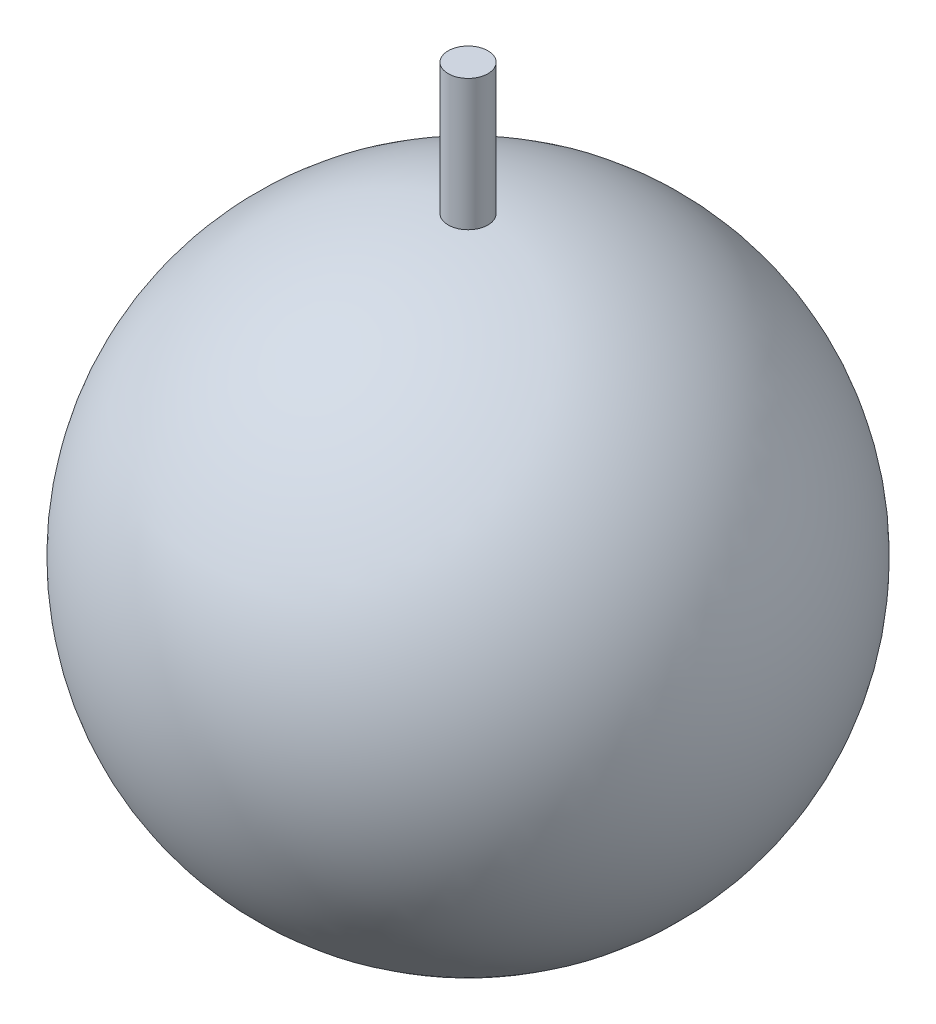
ISO-10303-21;
HEADER;
FILE_DESCRIPTION(('STEP AP214'),'2;1');
FILE_NAME('part.step','',(''),(''),'','','');
FILE_SCHEMA(('AUTOMOTIVE_DESIGN { 1 0 10303 214 1 1 1 1 }'));
ENDSEC;
DATA;
#1=APPLICATION_CONTEXT('core data for automotive mechanical design processes');
#2=APPLICATION_PROTOCOL_DEFINITION('international standard','automotive_design',2000,#1);
#3=PRODUCT_CONTEXT('',#1,'mechanical');
#4=PRODUCT('Part','Part','',(#3));
#5=PRODUCT_RELATED_PRODUCT_CATEGORY('part','',(#4));
#6=PRODUCT_DEFINITION_FORMATION('','',#4);
#7=PRODUCT_DEFINITION_CONTEXT('part definition',#1,'design');
#8=PRODUCT_DEFINITION('design','',#6,#7);
#9=PRODUCT_DEFINITION_SHAPE('','',#8);
#10=(LENGTH_UNIT() NAMED_UNIT(*) SI_UNIT(.MILLI.,.METRE.));
#11=(NAMED_UNIT(*) PLANE_ANGLE_UNIT() SI_UNIT($,.RADIAN.));
#12=(NAMED_UNIT(*) SI_UNIT($,.STERADIAN.) SOLID_ANGLE_UNIT());
#13=UNCERTAINTY_MEASURE_WITH_UNIT(LENGTH_MEASURE(1.E-05),#10,'distance_accuracy_value','');
#14=(GEOMETRIC_REPRESENTATION_CONTEXT(3) GLOBAL_UNCERTAINTY_ASSIGNED_CONTEXT((#13)) GLOBAL_UNIT_ASSIGNED_CONTEXT((#10,
#11,#12)) REPRESENTATION_CONTEXT('',''));
#15=CARTESIAN_POINT('',(0.,0.,0.));
#16=DIRECTION('',(0.,0.,1.));
#17=DIRECTION('',(1.,0.,0.));
#18=AXIS2_PLACEMENT_3D('',#15,#16,#17);
#19=CARTESIAN_POINT('',(0.,36.5926406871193,0.));
#20=DIRECTION('',(0.,-1.,0.));
#21=DIRECTION('',(0.,0.,-1.));
#22=AXIS2_PLACEMENT_3D('',#19,#20,#21);
#23=CYLINDRICAL_SURFACE('',#22,1.5);
#24=CARTESIAN_POINT('',(0.,32.35,0.));
#25=DIRECTION('',(0.,-1.,0.));
#26=DIRECTION('',(1.,0.,0.));
#27=AXIS2_PLACEMENT_3D('',#24,#25,#26);
#28=CIRCLE('',#27,1.5);
#29=CARTESIAN_POINT('',(1.5,32.35,0.));
#30=VERTEX_POINT('',#29);
#31=EDGE_CURVE('E40',#30,#30,#28,.F.);
#32=ORIENTED_EDGE('',*,*,#31,.F.);
#33=EDGE_LOOP('',(#32));
#34=FACE_BOUND('',#33,.T.);
#35=CARTESIAN_POINT('',(0.,22.4499443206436,0.));
#36=DIRECTION('',(0.,-1.,0.));
#37=DIRECTION('',(0.,0.,-1.));
#38=AXIS2_PLACEMENT_3D('',#35,#36,#37);
#39=CIRCLE('',#38,1.5);
#40=CARTESIAN_POINT('',(0.,22.4499443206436,-1.5));
#41=VERTEX_POINT('',#40);
#42=EDGE_CURVE('E10',#41,#41,#39,.T.);
#43=ORIENTED_EDGE('',*,*,#42,.F.);
#44=EDGE_LOOP('',(#43));
#45=FACE_BOUND('',#44,.T.);
#46=ADVANCED_FACE('F33',(#34,#45),#23,.T.);
#47=CARTESIAN_POINT('',(43.3012701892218,32.35,25.));
#48=DIRECTION('',(0.,-1.,0.));
#49=DIRECTION('',(-1.,0.,0.));
#50=AXIS2_PLACEMENT_3D('',#47,#48,#49);
#51=PLANE('',#50);
#52=ORIENTED_EDGE('',*,*,#31,.T.);
#53=EDGE_LOOP('',(#52));
#54=FACE_BOUND('',#53,.T.);
#55=ADVANCED_FACE('F46',(#54),#51,.F.);
#56=CARTESIAN_POINT('',(0.,0.,0.));
#57=DIRECTION('',(-1.,0.,0.));
#58=DIRECTION('',(0.,1.,0.));
#59=AXIS2_PLACEMENT_3D('',#56,#57,#58);
#60=SPHERICAL_SURFACE('',#59,22.5);
#61=CARTESIAN_POINT('',(0.,0.,0.));
#62=DIRECTION('',(0.,-1.,0.));
#63=DIRECTION('',(0.,0.,-1.));
#64=AXIS2_PLACEMENT_3D('',#61,#62,#63);
#65=SPHERICAL_SURFACE('',#64,22.5);
#66=ORIENTED_EDGE('',*,*,#42,.T.);
#67=EDGE_LOOP('',(#66));
#68=FACE_BOUND('',#67,.T.);
#69=ADVANCED_FACE('F35',(#68),#65,.T.);
#70=CLOSED_SHELL('',(#46,#55,#69));
#71=MANIFOLD_SOLID_BREP('B2',#70);
#72=ADVANCED_BREP_SHAPE_REPRESENTATION('',(#18,#71),#14);
#73=SHAPE_DEFINITION_REPRESENTATION(#9,#72);
ENDSEC;
END-ISO-10303-21;
